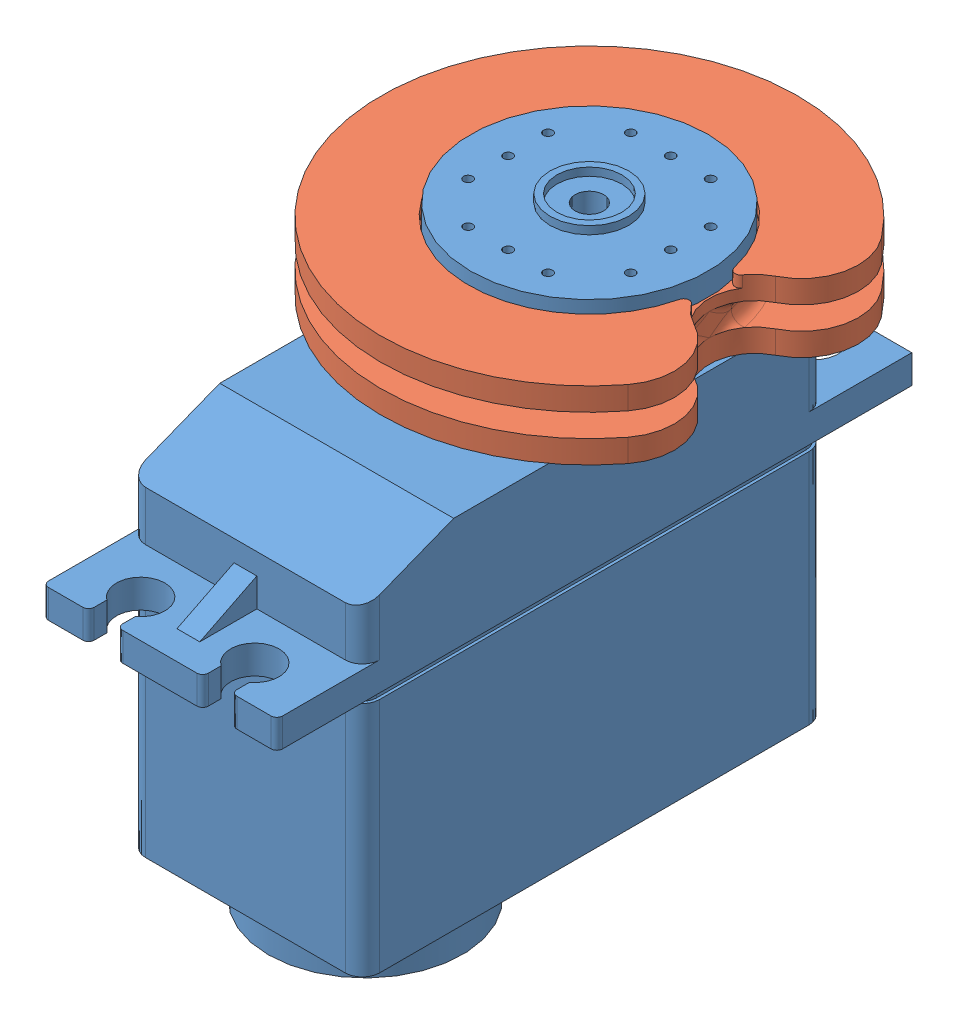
SolidWorks assembly block_power_t42.SLDASM, configuration Default (file format 6000). Lengths in mm.
Overall size (33.76 43.7 55.89).
2 component instances, 2 part files, 3 mates.
Components (placement in the parent):
- servo - powerhd 1501mg-1: servo - powerhd 1501mg.SLDPRT [Default] at origin size (20.8 43.7 55.64)
- b1_power_t42-1: b1_power_t42.SLDPRT [Default] at (0 43.25 -30.14) x (1 0 0) z (0 1 0) size (33.76 36.5 6)
Mates (geometry in assembly coordinates):
- Concentric1: concentric aligned: cylinder of servo - powerhd 1501mg-1 through (0 47.25 -30.14) axis (0 -1 0) radius 10.4; cylinder of b1_power_t42-1 through (0 46.25 -30.14) axis (0 -1 0) radius 4.5
- Coincident1: coincident anti-aligned: plane of servo - powerhd 1501mg-1 through (0 45.25 -30.14) normal (0 -1 0); plane of b1_power_t42-1 through (0 45.25 -30.14) normal (0 1 0)
- Concentric2: concentric anti-aligned: cylinder of servo - powerhd 1501mg-1 through (7.125 44.1186 -30.14) axis (0 1 0) radius 0.4; cylinder of b1_power_t42-1 through (7.125 46.25 -30.14) axis (0 -1 0) radius 1
